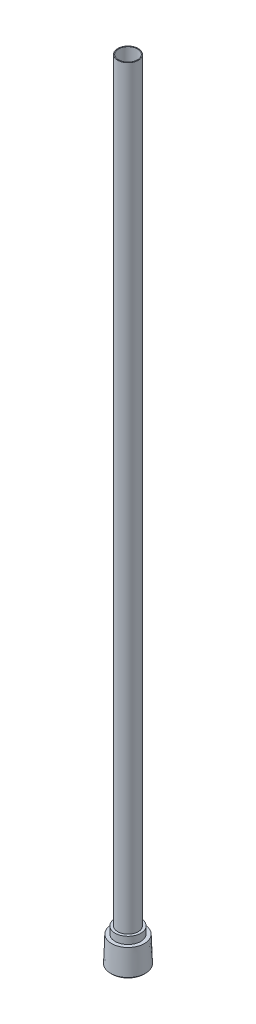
from build123d import *

# Parameters (mm, degrees)
CUT_EXTRUDE2_DEPTH = 7.9248
SKETCH2_R          = 3.6576
CUT_EXTRUDE1_DEPTH = 296.8752
CHAMFER1_SIZE      = 0.508
CHAMFER1_SIZE2     = 0.49045616


with BuildPart() as part:
    # Sketch1 → Revolve1 (revolve)
    with BuildSketch(Plane(origin=(0, 0, 0), x_dir=(0, 0, -1), z_dir=(1, 0, 0)), mode=Mode.PRIVATE) as revolve1_sk:
        Polygon((0, 304.8), (0, 0), (6.7183, 0), (6.34232417, 10.3124), (4.953, 10.3124), (4.953, 13.081), (3.9624, 13.081), (3.9624, 304.8), align=None)
    revolve(revolve1_sk.sketch.rotate(Axis((0, 0, 0), (0, -1, 0)), 180), axis=Axis((0, 0, 0), (0, -1, 0)))

    # Sketch3 → Cut-Extrude2 (cut)
    with BuildSketch(Plane(origin=(0, 0, 0), x_dir=(-1, 0, 0), z_dir=(0, -1, 0))):
        Polygon((0, -3.666174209), (3.175, -1.833087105), (3.175, 1.833087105), (0, 3.666174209), (-3.175, 1.833087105), (-3.175, -1.833087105), align=None)
    extrude(amount=-CUT_EXTRUDE2_DEPTH, mode=Mode.SUBTRACT)

    # Sketch2 → Cut-Extrude1 (cut)
    with BuildSketch(Plane(origin=(0, 304.8, 0), x_dir=(1, 0, 0), z_dir=(0, 1, 0))):
        with Locations(Location((0, 0, 0), (0, 0, 270))):
            Circle(SKETCH2_R)
    extrude(amount=-CUT_EXTRUDE1_DEPTH, mode=Mode.SUBTRACT)

    # Chamfer1
    chamfer1_edges = [part.edges().sort_by_distance(p)[0] for p in [
        (0, 0, -6.7183),
    ]]
    chamfer1_side = [part.faces().sort_by_distance(p)[0] for p in [
        (0, 0, -6.52827778),
    ]]
    chamfer(chamfer1_edges, length=CHAMFER1_SIZE, length2=CHAMFER1_SIZE2, reference=chamfer1_side[0])


solid = part.part
